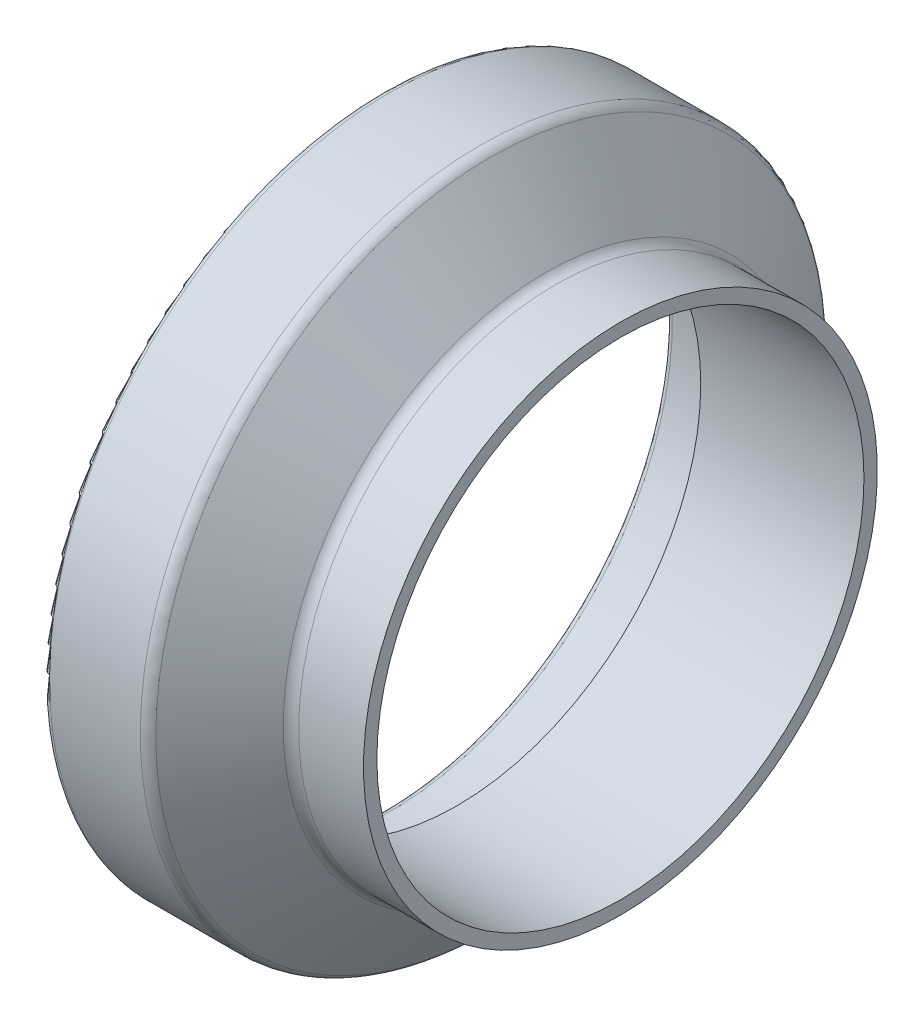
from build123d import *


with BuildPart() as part:
    # Sketch1 → Revolve1 (revolve)
    with BuildSketch(Plane.XY):
        with BuildLine():
            Line((-6.427183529, 30.099), (-26.594783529, 30.099))
            Line((-26.594783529, 30.099), (-26.594783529, 34.1503))
            ThreePointArc((-26.594783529, 34.1503), (-26.832847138, 34.725036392), (-27.407583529, 34.9631))
            Line((-27.407583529, 34.9631), (-34.976783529, 34.9631))
            ThreePointArc((-34.976783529, 34.9631), (-35.551519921, 35.201163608), (-35.789583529, 35.7759))
            Line((-35.789583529, 35.7759), (-35.789583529, 41.1861))
            ThreePointArc((-35.789583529, 41.1861), (-35.551519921, 41.760836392), (-34.976783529, 41.9989))
            Line((-34.976783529, 41.9989), (-23.760413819, 41.9989))
            ThreePointArc((-23.760413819, 41.9989), (-23.046408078, 41.830773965), (-22.482437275, 41.3617244))
            Line((-22.482437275, 41.3617244), (-15.719629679, 32.3871756))
            ThreePointArc((-15.719629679, 32.3871756), (-15.155658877, 31.918126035), (-14.441653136, 31.75))
            Line((-14.441653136, 31.75), (-6.427183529, 31.75))
            Line((-6.427183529, 31.75), (-6.427183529, 30.099))
        make_face()
    revolve(axis=Axis((0, 0, 0), (-1, 0, 0)))


solid = part.part
